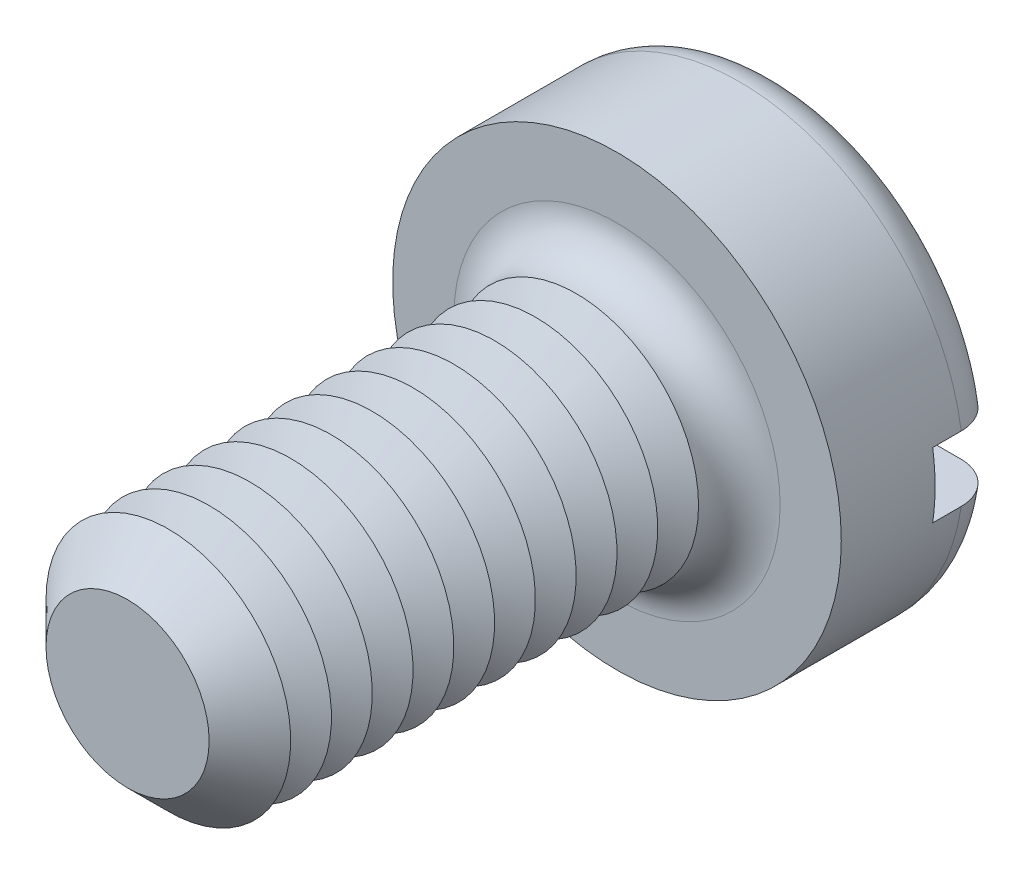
from build123d import *

# Parameters (mm, degrees)
SKETCH3_R           = 2.75
BOSS_EXTRUDE2_DEPTH = 2
SKETCH4_R           = 1.5
BOSS_EXTRUDE3_DEPTH = 6
FILLET1_R           = 0.5
CHAMFER1_SIZE       = 0.5
LPATTERN1_COUNT     = 10
LPATTERN1_PITCH     = 0.5
SKETCH8_W           = 5.5
SKETCH8_H           = 0.8
CUT_EXTRUDE1_DEPTH  = 0.85


with BuildPart() as part:
    # Sketch3 → Boss-Extrude2 (new body)
    with BuildSketch(Plane.XY):
        Circle(SKETCH3_R)
    extrude(amount=-BOSS_EXTRUDE2_DEPTH)

    # Sketch4 → Boss-Extrude3 (add)
    with BuildSketch(Plane.XY):
        Circle(SKETCH4_R)
    extrude(amount=BOSS_EXTRUDE3_DEPTH)

    # Fillet1
    fillet1_edges = [part.edges().sort_by_distance(p)[0] for p in [
        (-2.75, 0, -2),
        (-1.5, 0, 0),
    ]]
    fillet(fillet1_edges, radius=FILLET1_R)

    # Chamfer1
    chamfer1_edges = [part.edges().sort_by_distance(p)[0] for p in [
        (-1.5, 0, 6),
    ]]
    chamfer(chamfer1_edges, length=CHAMFER1_SIZE)

    # Sketch6 → Cut-Revolve1 (revolve, cut)
    with BuildSketch(Plane(origin=(0, 0, 0), x_dir=(0, 0, -1), z_dir=(1, 0, 0)), mode=Mode.PRIVATE) as cut_revolve1_sk:
        Polygon((-0.5, 1.5), (-0.75, 1.066987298), (-1, 1.5), align=None)
    cut_revolve1 = revolve(cut_revolve1_sk.sketch.rotate(Axis((0, 0, -1.694361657), (0, 0, 1)), 90), axis=Axis((0, 0, -1.694361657), (0, 0, 1)), mode=Mode.SUBTRACT)

    # LPattern1: Cut-Revolve1 ×10
    with Locations(*[(0, 0, i * LPATTERN1_PITCH) for i in range(1, LPATTERN1_COUNT)]):
        add(cut_revolve1, mode=Mode.SUBTRACT)

    # Sketch8 → Cut-Extrude1 (cut)
    with BuildSketch(Plane(origin=(0, 0, -2), x_dir=(-1, 0, 0), z_dir=(0, 0, -1))):
        Rectangle(SKETCH8_W, SKETCH8_H)
    extrude(amount=-CUT_EXTRUDE1_DEPTH, mode=Mode.SUBTRACT)


solid = part.part
